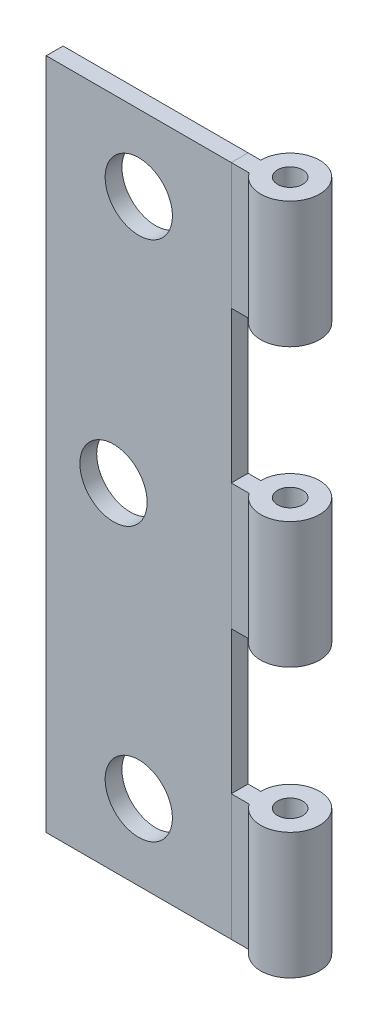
ISO-10303-21;
HEADER;
FILE_DESCRIPTION(('STEP AP214'),'2;1');
FILE_NAME('part.step','',(''),(''),'','','');
FILE_SCHEMA(('AUTOMOTIVE_DESIGN { 1 0 10303 214 1 1 1 1 }'));
ENDSEC;
DATA;
#1=APPLICATION_CONTEXT('core data for automotive mechanical design processes');
#2=APPLICATION_PROTOCOL_DEFINITION('international standard','automotive_design',2000,#1);
#3=PRODUCT_CONTEXT('',#1,'mechanical');
#4=PRODUCT('Part','Part','',(#3));
#5=PRODUCT_RELATED_PRODUCT_CATEGORY('part','',(#4));
#6=PRODUCT_DEFINITION_FORMATION('','',#4);
#7=PRODUCT_DEFINITION_CONTEXT('part definition',#1,'design');
#8=PRODUCT_DEFINITION('design','',#6,#7);
#9=PRODUCT_DEFINITION_SHAPE('','',#8);
#10=(LENGTH_UNIT() NAMED_UNIT(*) SI_UNIT(.MILLI.,.METRE.));
#11=(NAMED_UNIT(*) PLANE_ANGLE_UNIT() SI_UNIT($,.RADIAN.));
#12=(NAMED_UNIT(*) SI_UNIT($,.STERADIAN.) SOLID_ANGLE_UNIT());
#13=UNCERTAINTY_MEASURE_WITH_UNIT(LENGTH_MEASURE(1.E-05),#10,'distance_accuracy_value','');
#14=(GEOMETRIC_REPRESENTATION_CONTEXT(3) GLOBAL_UNCERTAINTY_ASSIGNED_CONTEXT((#13)) GLOBAL_UNIT_ASSIGNED_CONTEXT((#10,
#11,#12)) REPRESENTATION_CONTEXT('',''));
#15=CARTESIAN_POINT('',(0.,0.,0.));
#16=DIRECTION('',(0.,0.,1.));
#17=DIRECTION('',(1.,0.,0.));
#18=AXIS2_PLACEMENT_3D('',#15,#16,#17);
#19=CARTESIAN_POINT('',(12.7,-39.6077241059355,-1.5875));
#20=DIRECTION('',(0.,1.,0.));
#21=DIRECTION('',(0.,0.,1.));
#22=AXIS2_PLACEMENT_3D('',#19,#20,#21);
#23=CYLINDRICAL_SURFACE('',#22,1.190625);
#24=CARTESIAN_POINT('',(12.7,5.55624999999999,-1.5875));
#25=DIRECTION('',(0.,-1.,0.));
#26=DIRECTION('',(0.,0.,-1.));
#27=AXIS2_PLACEMENT_3D('',#24,#25,#26);
#28=CIRCLE('',#27,1.190625);
#29=CARTESIAN_POINT('',(12.7,5.55624999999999,-2.778125));
#30=VERTEX_POINT('',#29);
#31=EDGE_CURVE('E138',#30,#30,#28,.F.);
#32=ORIENTED_EDGE('',*,*,#31,.T.);
#33=EDGE_LOOP('',(#32));
#34=FACE_BOUND('',#33,.T.);
#35=CARTESIAN_POINT('',(12.7,-6.35,-1.5875));
#36=DIRECTION('',(0.,-1.,0.));
#37=DIRECTION('',(0.,0.,-1.));
#38=AXIS2_PLACEMENT_3D('',#35,#36,#37);
#39=CIRCLE('',#38,1.190625);
#40=CARTESIAN_POINT('',(12.7,-6.35,-2.778125));
#41=VERTEX_POINT('',#40);
#42=EDGE_CURVE('E13',#41,#41,#39,.F.);
#43=ORIENTED_EDGE('',*,*,#42,.F.);
#44=EDGE_LOOP('',(#43));
#45=FACE_BOUND('',#44,.T.);
#46=ADVANCED_FACE('F67',(#34,#45),#23,.F.);
#47=CARTESIAN_POINT('',(8.73125000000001,-39.6077241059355,0.));
#48=DIRECTION('',(0.,0.,1.));
#49=DIRECTION('',(1.,0.,0.));
#50=AXIS2_PLACEMENT_3D('',#47,#48,#49);
#51=PLANE('',#50);
#52=DIRECTION('',(0.,1.,0.));
#53=VECTOR('',#52,1.);
#54=CARTESIAN_POINT('',(8.73125000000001,-39.6077241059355,0.));
#55=LINE('',#54,#53);
#56=CARTESIAN_POINT('',(8.73125000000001,-6.35,0.));
#57=VERTEX_POINT('',#56);
#58=CARTESIAN_POINT('',(8.73125000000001,5.55625,0.));
#59=VERTEX_POINT('',#58);
#60=EDGE_CURVE('E129',#57,#59,#55,.T.);
#61=ORIENTED_EDGE('',*,*,#60,.F.);
#62=DIRECTION('',(1.,0.,0.));
#63=VECTOR('',#62,1.);
#64=CARTESIAN_POINT('',(8.73125000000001,-6.35,0.));
#65=LINE('',#64,#63);
#66=CARTESIAN_POINT('',(10.4201266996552,-6.35,0.));
#67=VERTEX_POINT('',#66);
#68=EDGE_CURVE('E84',#57,#67,#65,.T.);
#69=ORIENTED_EDGE('',*,*,#68,.T.);
#70=DIRECTION('',(0.,1.,0.));
#71=VECTOR('',#70,1.);
#72=CARTESIAN_POINT('',(10.4201266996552,-39.6077241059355,0.));
#73=LINE('',#72,#71);
#74=CARTESIAN_POINT('',(10.4201266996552,5.55624999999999,0.));
#75=VERTEX_POINT('',#74);
#76=EDGE_CURVE('E71',#67,#75,#73,.T.);
#77=ORIENTED_EDGE('',*,*,#76,.T.);
#78=DIRECTION('',(1.,0.,0.));
#79=VECTOR('',#78,1.);
#80=CARTESIAN_POINT('',(8.73125000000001,5.55624999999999,0.));
#81=LINE('',#80,#79);
#82=EDGE_CURVE('E135',#59,#75,#81,.T.);
#83=ORIENTED_EDGE('',*,*,#82,.F.);
#84=EDGE_LOOP('',(#61,#69,#77,#83));
#85=FACE_BOUND('',#84,.T.);
#86=ADVANCED_FACE('F69',(#85),#51,.T.);
#87=CARTESIAN_POINT('',(8.73125000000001,-39.6077241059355,-1.5875));
#88=DIRECTION('',(0.,0.,1.));
#89=DIRECTION('',(1.,0.,0.));
#90=AXIS2_PLACEMENT_3D('',#87,#88,#89);
#91=PLANE('',#90);
#92=DIRECTION('',(1.,0.,0.));
#93=VECTOR('',#92,1.);
#94=CARTESIAN_POINT('',(8.73125000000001,-6.35,-1.5875));
#95=LINE('',#94,#93);
#96=CARTESIAN_POINT('',(8.73125000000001,-6.35,-1.5875));
#97=VERTEX_POINT('',#96);
#98=CARTESIAN_POINT('',(9.92187500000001,-6.35,-1.5875));
#99=VERTEX_POINT('',#98);
#100=EDGE_CURVE('E76',#97,#99,#95,.T.);
#101=ORIENTED_EDGE('',*,*,#100,.F.);
#102=DIRECTION('',(0.,1.,0.));
#103=VECTOR('',#102,1.);
#104=CARTESIAN_POINT('',(8.73125000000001,-39.6077241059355,-1.5875));
#105=LINE('',#104,#103);
#106=CARTESIAN_POINT('',(8.73125000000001,5.55624999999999,-1.5875));
#107=VERTEX_POINT('',#106);
#108=EDGE_CURVE('E115',#97,#107,#105,.T.);
#109=ORIENTED_EDGE('',*,*,#108,.T.);
#110=DIRECTION('',(1.,0.,0.));
#111=VECTOR('',#110,1.);
#112=CARTESIAN_POINT('',(8.73125000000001,5.55624999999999,-1.5875));
#113=LINE('',#112,#111);
#114=CARTESIAN_POINT('',(9.92187500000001,5.55624999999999,-1.5875));
#115=VERTEX_POINT('',#114);
#116=EDGE_CURVE('E118',#107,#115,#113,.T.);
#117=ORIENTED_EDGE('',*,*,#116,.T.);
#118=DIRECTION('',(0.,1.,0.));
#119=VECTOR('',#118,1.);
#120=CARTESIAN_POINT('',(9.92187500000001,-39.6077241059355,-1.5875));
#121=LINE('',#120,#119);
#122=EDGE_CURVE('E103',#99,#115,#121,.T.);
#123=ORIENTED_EDGE('',*,*,#122,.F.);
#124=EDGE_LOOP('',(#101,#109,#117,#123));
#125=FACE_BOUND('',#124,.T.);
#126=ADVANCED_FACE('F117',(#125),#91,.F.);
#127=CARTESIAN_POINT('',(8.73125000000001,-39.6077241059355,-1.5875));
#128=DIRECTION('',(-1.,0.,0.));
#129=DIRECTION('',(0.,0.,1.));
#130=AXIS2_PLACEMENT_3D('',#127,#128,#129);
#131=PLANE('',#130);
#132=ORIENTED_EDGE('',*,*,#108,.F.);
#133=DIRECTION('',(0.,0.,-1.));
#134=VECTOR('',#133,1.);
#135=CARTESIAN_POINT('',(8.73125000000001,-6.35,1.190625));
#136=LINE('',#135,#134);
#137=EDGE_CURVE('E95',#57,#97,#136,.T.);
#138=ORIENTED_EDGE('',*,*,#137,.F.);
#139=ORIENTED_EDGE('',*,*,#60,.T.);
#140=DIRECTION('',(0.,0.,1.));
#141=VECTOR('',#140,1.);
#142=CARTESIAN_POINT('',(8.73125000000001,5.55624999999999,-1.5875));
#143=LINE('',#142,#141);
#144=EDGE_CURVE('E126',#107,#59,#143,.T.);
#145=ORIENTED_EDGE('',*,*,#144,.F.);
#146=EDGE_LOOP('',(#132,#138,#139,#145));
#147=FACE_BOUND('',#146,.T.);
#148=ADVANCED_FACE('F131',(#147),#131,.T.);
#149=CARTESIAN_POINT('',(12.7,-39.6077241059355,-1.5875));
#150=DIRECTION('',(0.,1.,0.));
#151=DIRECTION('',(0.,0.,1.));
#152=AXIS2_PLACEMENT_3D('',#149,#150,#151);
#153=CYLINDRICAL_SURFACE('',#152,2.778125);
#154=CARTESIAN_POINT('',(12.7,-6.35,-1.5875));
#155=DIRECTION('',(0.,-1.,0.));
#156=DIRECTION('',(0.,0.,-1.));
#157=AXIS2_PLACEMENT_3D('',#154,#155,#156);
#158=CIRCLE('',#157,2.778125);
#159=EDGE_CURVE('E90',#67,#99,#158,.F.);
#160=ORIENTED_EDGE('',*,*,#159,.T.);
#161=ORIENTED_EDGE('',*,*,#122,.T.);
#162=CARTESIAN_POINT('',(12.7,5.55624999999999,-1.5875));
#163=DIRECTION('',(0.,-1.,0.));
#164=DIRECTION('',(0.,0.,-1.));
#165=AXIS2_PLACEMENT_3D('',#162,#163,#164);
#166=CIRCLE('',#165,2.778125);
#167=EDGE_CURVE('E128',#75,#115,#166,.F.);
#168=ORIENTED_EDGE('',*,*,#167,.F.);
#169=ORIENTED_EDGE('',*,*,#76,.F.);
#170=EDGE_LOOP('',(#160,#161,#168,#169));
#171=FACE_BOUND('',#170,.T.);
#172=ADVANCED_FACE('F147',(#171),#153,.T.);
#173=CARTESIAN_POINT('',(0.,5.55625,1.190625));
#174=DIRECTION('',(0.,-1.,0.));
#175=DIRECTION('',(0.,0.,-1.));
#176=AXIS2_PLACEMENT_3D('',#173,#174,#175);
#177=PLANE('',#176);
#178=ORIENTED_EDGE('',*,*,#82,.T.);
#179=ORIENTED_EDGE('',*,*,#167,.T.);
#180=ORIENTED_EDGE('',*,*,#116,.F.);
#181=ORIENTED_EDGE('',*,*,#144,.T.);
#182=EDGE_LOOP('',(#178,#179,#180,#181));
#183=FACE_BOUND('',#182,.T.);
#184=ORIENTED_EDGE('',*,*,#31,.F.);
#185=EDGE_LOOP('',(#184));
#186=FACE_BOUND('',#185,.T.);
#187=ADVANCED_FACE('F124',(#183,#186),#177,.F.);
#188=CARTESIAN_POINT('',(0.,-6.35,1.190625));
#189=DIRECTION('',(0.,-1.,0.));
#190=DIRECTION('',(0.,0.,-1.));
#191=AXIS2_PLACEMENT_3D('',#188,#189,#190);
#192=PLANE('',#191);
#193=ORIENTED_EDGE('',*,*,#137,.T.);
#194=ORIENTED_EDGE('',*,*,#100,.T.);
#195=ORIENTED_EDGE('',*,*,#159,.F.);
#196=ORIENTED_EDGE('',*,*,#68,.F.);
#197=EDGE_LOOP('',(#193,#194,#195,#196));
#198=FACE_BOUND('',#197,.T.);
#199=ORIENTED_EDGE('',*,*,#42,.T.);
#200=EDGE_LOOP('',(#199));
#201=FACE_BOUND('',#200,.T.);
#202=ADVANCED_FACE('F161',(#198,#201),#192,.T.);
#203=CLOSED_SHELL('',(#46,#86,#126,#148,#172,#187,#202));
#204=MANIFOLD_SOLID_BREP('B2',#203);
#205=CARTESIAN_POINT('',(12.7,-39.6077241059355,-1.5875));
#206=DIRECTION('',(0.,1.,0.));
#207=DIRECTION('',(0.,0.,1.));
#208=AXIS2_PLACEMENT_3D('',#205,#206,#207);
#209=CYLINDRICAL_SURFACE('',#208,1.190625);
#210=CARTESIAN_POINT('',(12.7,-31.75,-1.5875));
#211=DIRECTION('',(0.,-1.,0.));
#212=DIRECTION('',(0.,0.,-1.));
#213=AXIS2_PLACEMENT_3D('',#210,#211,#212);
#214=CIRCLE('',#213,1.190625);
#215=CARTESIAN_POINT('',(12.7,-31.75,-2.778125));
#216=VERTEX_POINT('',#215);
#217=EDGE_CURVE('E231',#216,#216,#214,.F.);
#218=ORIENTED_EDGE('',*,*,#217,.F.);
#219=EDGE_LOOP('',(#218));
#220=FACE_BOUND('',#219,.T.);
#221=CARTESIAN_POINT('',(12.7,-19.84375,-1.5875));
#222=DIRECTION('',(0.,1.,0.));
#223=DIRECTION('',(0.,0.,1.));
#224=AXIS2_PLACEMENT_3D('',#221,#222,#223);
#225=CIRCLE('',#224,1.190625);
#226=CARTESIAN_POINT('',(12.7,-19.84375,-0.396875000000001));
#227=VERTEX_POINT('',#226);
#228=EDGE_CURVE('E282',#227,#227,#225,.F.);
#229=ORIENTED_EDGE('',*,*,#228,.F.);
#230=EDGE_LOOP('',(#229));
#231=FACE_BOUND('',#230,.T.);
#232=ADVANCED_FACE('F222',(#220,#231),#209,.F.);
#233=CARTESIAN_POINT('',(-8.73124999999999,-31.75,-1.5875));
#234=DIRECTION('',(0.,-1.,0.));
#235=DIRECTION('',(0.,0.,-1.));
#236=AXIS2_PLACEMENT_3D('',#233,#234,#235);
#237=PLANE('',#236);
#238=CARTESIAN_POINT('',(12.7,-31.75,-1.5875));
#239=DIRECTION('',(0.,-1.,0.));
#240=DIRECTION('',(0.,0.,-1.));
#241=AXIS2_PLACEMENT_3D('',#238,#239,#240);
#242=CIRCLE('',#241,2.778125);
#243=CARTESIAN_POINT('',(10.4201266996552,-31.75,0.));
#244=VERTEX_POINT('',#243);
#245=CARTESIAN_POINT('',(9.92187500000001,-31.75,-1.5875));
#246=VERTEX_POINT('',#245);
#247=EDGE_CURVE('E285',#244,#246,#242,.F.);
#248=ORIENTED_EDGE('',*,*,#247,.F.);
#249=DIRECTION('',(1.,0.,0.));
#250=VECTOR('',#249,1.);
#251=CARTESIAN_POINT('',(8.73125000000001,-31.75,0.));
#252=LINE('',#251,#250);
#253=CARTESIAN_POINT('',(8.73125000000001,-31.75,0.));
#254=VERTEX_POINT('',#253);
#255=EDGE_CURVE('E293',#254,#244,#252,.T.);
#256=ORIENTED_EDGE('',*,*,#255,.F.);
#257=DIRECTION('',(0.,0.,1.));
#258=VECTOR('',#257,1.);
#259=CARTESIAN_POINT('',(8.73125000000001,-31.75,-1.5875));
#260=LINE('',#259,#258);
#261=CARTESIAN_POINT('',(8.73125000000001,-31.75,-1.5875));
#262=VERTEX_POINT('',#261);
#263=EDGE_CURVE('E239',#262,#254,#260,.T.);
#264=ORIENTED_EDGE('',*,*,#263,.F.);
#265=DIRECTION('',(1.,0.,0.));
#266=VECTOR('',#265,1.);
#267=CARTESIAN_POINT('',(8.73125000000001,-31.75,-1.5875));
#268=LINE('',#267,#266);
#269=EDGE_CURVE('E301',#262,#246,#268,.T.);
#270=ORIENTED_EDGE('',*,*,#269,.T.);
#271=EDGE_LOOP('',(#248,#256,#264,#270));
#272=FACE_BOUND('',#271,.T.);
#273=ORIENTED_EDGE('',*,*,#217,.T.);
#274=EDGE_LOOP('',(#273));
#275=FACE_BOUND('',#274,.T.);
#276=ADVANCED_FACE('F303',(#272,#275),#237,.T.);
#277=CARTESIAN_POINT('',(8.73125000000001,-39.6077241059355,-1.5875));
#278=DIRECTION('',(-1.,0.,0.));
#279=DIRECTION('',(0.,0.,1.));
#280=AXIS2_PLACEMENT_3D('',#277,#278,#279);
#281=PLANE('',#280);
#282=DIRECTION('',(0.,1.,0.));
#283=VECTOR('',#282,1.);
#284=CARTESIAN_POINT('',(8.73125000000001,-39.6077241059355,0.));
#285=LINE('',#284,#283);
#286=CARTESIAN_POINT('',(8.73125000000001,-19.84375,0.));
#287=VERTEX_POINT('',#286);
#288=EDGE_CURVE('E280',#254,#287,#285,.T.);
#289=ORIENTED_EDGE('',*,*,#288,.T.);
#290=DIRECTION('',(0.,0.,-1.));
#291=VECTOR('',#290,1.);
#292=CARTESIAN_POINT('',(8.73125000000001,-19.84375,1.190625));
#293=LINE('',#292,#291);
#294=CARTESIAN_POINT('',(8.73125000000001,-19.84375,-1.5875));
#295=VERTEX_POINT('',#294);
#296=EDGE_CURVE('E265',#287,#295,#293,.T.);
#297=ORIENTED_EDGE('',*,*,#296,.T.);
#298=DIRECTION('',(0.,1.,0.));
#299=VECTOR('',#298,1.);
#300=CARTESIAN_POINT('',(8.73125000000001,-39.6077241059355,-1.5875));
#301=LINE('',#300,#299);
#302=EDGE_CURVE('E289',#262,#295,#301,.T.);
#303=ORIENTED_EDGE('',*,*,#302,.F.);
#304=ORIENTED_EDGE('',*,*,#263,.T.);
#305=EDGE_LOOP('',(#289,#297,#303,#304));
#306=FACE_BOUND('',#305,.T.);
#307=ADVANCED_FACE('F284',(#306),#281,.T.);
#308=CARTESIAN_POINT('',(12.7,-39.6077241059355,-1.5875));
#309=DIRECTION('',(0.,1.,0.));
#310=DIRECTION('',(0.,0.,1.));
#311=AXIS2_PLACEMENT_3D('',#308,#309,#310);
#312=CYLINDRICAL_SURFACE('',#311,2.778125);
#313=CARTESIAN_POINT('',(12.7,-19.84375,-1.5875));
#314=DIRECTION('',(0.,1.,0.));
#315=DIRECTION('',(0.,0.,1.));
#316=AXIS2_PLACEMENT_3D('',#313,#314,#315);
#317=CIRCLE('',#316,2.778125);
#318=CARTESIAN_POINT('',(9.92187500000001,-19.84375,-1.5875));
#319=VERTEX_POINT('',#318);
#320=CARTESIAN_POINT('',(10.4201266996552,-19.84375,0.));
#321=VERTEX_POINT('',#320);
#322=EDGE_CURVE('E65',#319,#321,#317,.F.);
#323=ORIENTED_EDGE('',*,*,#322,.T.);
#324=DIRECTION('',(0.,1.,0.));
#325=VECTOR('',#324,1.);
#326=CARTESIAN_POINT('',(10.4201266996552,-39.6077241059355,0.));
#327=LINE('',#326,#325);
#328=EDGE_CURVE('E281',#244,#321,#327,.T.);
#329=ORIENTED_EDGE('',*,*,#328,.F.);
#330=ORIENTED_EDGE('',*,*,#247,.T.);
#331=DIRECTION('',(0.,1.,0.));
#332=VECTOR('',#331,1.);
#333=CARTESIAN_POINT('',(9.92187500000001,-39.6077241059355,-1.5875));
#334=LINE('',#333,#332);
#335=EDGE_CURVE('E250',#246,#319,#334,.T.);
#336=ORIENTED_EDGE('',*,*,#335,.T.);
#337=EDGE_LOOP('',(#323,#329,#330,#336));
#338=FACE_BOUND('',#337,.T.);
#339=ADVANCED_FACE('F224',(#338),#312,.T.);
#340=CARTESIAN_POINT('',(8.73125000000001,-39.6077241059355,-1.5875));
#341=DIRECTION('',(0.,0.,1.));
#342=DIRECTION('',(1.,0.,0.));
#343=AXIS2_PLACEMENT_3D('',#340,#341,#342);
#344=PLANE('',#343);
#345=DIRECTION('',(-1.,0.,0.));
#346=VECTOR('',#345,1.);
#347=CARTESIAN_POINT('',(8.73125000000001,-19.84375,-1.5875));
#348=LINE('',#347,#346);
#349=EDGE_CURVE('E271',#319,#295,#348,.T.);
#350=ORIENTED_EDGE('',*,*,#349,.F.);
#351=ORIENTED_EDGE('',*,*,#335,.F.);
#352=ORIENTED_EDGE('',*,*,#269,.F.);
#353=ORIENTED_EDGE('',*,*,#302,.T.);
#354=EDGE_LOOP('',(#350,#351,#352,#353));
#355=FACE_BOUND('',#354,.T.);
#356=ADVANCED_FACE('F306',(#355),#344,.F.);
#357=CARTESIAN_POINT('',(8.73125000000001,-39.6077241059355,0.));
#358=DIRECTION('',(0.,0.,1.));
#359=DIRECTION('',(1.,0.,0.));
#360=AXIS2_PLACEMENT_3D('',#357,#358,#359);
#361=PLANE('',#360);
#362=ORIENTED_EDGE('',*,*,#328,.T.);
#363=DIRECTION('',(-1.,0.,0.));
#364=VECTOR('',#363,1.);
#365=CARTESIAN_POINT('',(8.73125000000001,-19.84375,0.));
#366=LINE('',#365,#364);
#367=EDGE_CURVE('E269',#321,#287,#366,.T.);
#368=ORIENTED_EDGE('',*,*,#367,.T.);
#369=ORIENTED_EDGE('',*,*,#288,.F.);
#370=ORIENTED_EDGE('',*,*,#255,.T.);
#371=EDGE_LOOP('',(#362,#368,#369,#370));
#372=FACE_BOUND('',#371,.T.);
#373=ADVANCED_FACE('F278',(#372),#361,.T.);
#374=CARTESIAN_POINT('',(0.,-19.84375,1.190625));
#375=DIRECTION('',(0.,1.,0.));
#376=DIRECTION('',(0.,0.,1.));
#377=AXIS2_PLACEMENT_3D('',#374,#375,#376);
#378=PLANE('',#377);
#379=ORIENTED_EDGE('',*,*,#367,.F.);
#380=ORIENTED_EDGE('',*,*,#322,.F.);
#381=ORIENTED_EDGE('',*,*,#349,.T.);
#382=ORIENTED_EDGE('',*,*,#296,.F.);
#383=EDGE_LOOP('',(#379,#380,#381,#382));
#384=FACE_BOUND('',#383,.T.);
#385=ORIENTED_EDGE('',*,*,#228,.T.);
#386=EDGE_LOOP('',(#385));
#387=FACE_BOUND('',#386,.T.);
#388=ADVANCED_FACE('F267',(#384,#387),#378,.T.);
#389=CLOSED_SHELL('',(#232,#276,#307,#339,#356,#373,#388));
#390=MANIFOLD_SOLID_BREP('B7',#389);
#391=CARTESIAN_POINT('',(12.7,-39.6077241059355,-1.5875));
#392=DIRECTION('',(0.,1.,0.));
#393=DIRECTION('',(0.,0.,1.));
#394=AXIS2_PLACEMENT_3D('',#391,#392,#393);
#395=CYLINDRICAL_SURFACE('',#394,1.190625);
#396=CARTESIAN_POINT('',(12.7,19.84375,-1.5875));
#397=DIRECTION('',(0.,1.,0.));
#398=DIRECTION('',(-1.,0.,0.));
#399=AXIS2_PLACEMENT_3D('',#396,#397,#398);
#400=CIRCLE('',#399,1.190625);
#401=CARTESIAN_POINT('',(11.509375,19.84375,-1.5875));
#402=VERTEX_POINT('',#401);
#403=EDGE_CURVE('E435',#402,#402,#400,.F.);
#404=ORIENTED_EDGE('',*,*,#403,.T.);
#405=EDGE_LOOP('',(#404));
#406=FACE_BOUND('',#405,.T.);
#407=CARTESIAN_POINT('',(12.7,31.75,-1.5875));
#408=DIRECTION('',(0.,1.,0.));
#409=DIRECTION('',(0.,0.,1.));
#410=AXIS2_PLACEMENT_3D('',#407,#408,#409);
#411=CIRCLE('',#410,1.190625);
#412=CARTESIAN_POINT('',(12.7,31.75,-0.396875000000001));
#413=VERTEX_POINT('',#412);
#414=EDGE_CURVE('E422',#413,#413,#411,.T.);
#415=ORIENTED_EDGE('',*,*,#414,.T.);
#416=EDGE_LOOP('',(#415));
#417=FACE_BOUND('',#416,.T.);
#418=ADVANCED_FACE('F379',(#406,#417),#395,.F.);
#419=CARTESIAN_POINT('',(0.,31.75,0.));
#420=DIRECTION('',(0.,1.,0.));
#421=DIRECTION('',(0.,0.,1.));
#422=AXIS2_PLACEMENT_3D('',#419,#420,#421);
#423=PLANE('',#422);
#424=DIRECTION('',(1.,0.,0.));
#425=VECTOR('',#424,1.);
#426=CARTESIAN_POINT('',(8.73125000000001,31.75,0.));
#427=LINE('',#426,#425);
#428=CARTESIAN_POINT('',(8.73125000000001,31.75,0.));
#429=VERTEX_POINT('',#428);
#430=CARTESIAN_POINT('',(10.4201266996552,31.75,0.));
#431=VERTEX_POINT('',#430);
#432=EDGE_CURVE('E425',#429,#431,#427,.T.);
#433=ORIENTED_EDGE('',*,*,#432,.T.);
#434=CARTESIAN_POINT('',(12.7,31.75,-1.5875));
#435=DIRECTION('',(0.,1.,0.));
#436=DIRECTION('',(0.,0.,1.));
#437=AXIS2_PLACEMENT_3D('',#434,#435,#436);
#438=CIRCLE('',#437,2.778125);
#439=CARTESIAN_POINT('',(9.92187500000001,31.75,-1.5875));
#440=VERTEX_POINT('',#439);
#441=EDGE_CURVE('E445',#431,#440,#438,.T.);
#442=ORIENTED_EDGE('',*,*,#441,.T.);
#443=DIRECTION('',(1.,0.,0.));
#444=VECTOR('',#443,1.);
#445=CARTESIAN_POINT('',(8.73125000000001,31.75,-1.5875));
#446=LINE('',#445,#444);
#447=CARTESIAN_POINT('',(8.73125000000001,31.75,-1.5875));
#448=VERTEX_POINT('',#447);
#449=EDGE_CURVE('E423',#448,#440,#446,.T.);
#450=ORIENTED_EDGE('',*,*,#449,.F.);
#451=DIRECTION('',(0.,0.,1.));
#452=VECTOR('',#451,1.);
#453=CARTESIAN_POINT('',(8.73125000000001,31.75,-1.5875));
#454=LINE('',#453,#452);
#455=EDGE_CURVE('E420',#448,#429,#454,.T.);
#456=ORIENTED_EDGE('',*,*,#455,.T.);
#457=EDGE_LOOP('',(#433,#442,#450,#456));
#458=FACE_BOUND('',#457,.T.);
#459=ORIENTED_EDGE('',*,*,#414,.F.);
#460=EDGE_LOOP('',(#459));
#461=FACE_BOUND('',#460,.T.);
#462=ADVANCED_FACE('F433',(#458,#461),#423,.T.);
#463=CARTESIAN_POINT('',(8.73125000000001,-39.6077241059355,-1.5875));
#464=DIRECTION('',(-1.,0.,0.));
#465=DIRECTION('',(0.,0.,1.));
#466=AXIS2_PLACEMENT_3D('',#463,#464,#465);
#467=PLANE('',#466);
#468=DIRECTION('',(0.,0.,-1.));
#469=VECTOR('',#468,1.);
#470=CARTESIAN_POINT('',(8.73125000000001,19.84375,-1.5875));
#471=LINE('',#470,#469);
#472=CARTESIAN_POINT('',(8.73125000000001,19.84375,0.));
#473=VERTEX_POINT('',#472);
#474=CARTESIAN_POINT('',(8.73125000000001,19.84375,-1.5875));
#475=VERTEX_POINT('',#474);
#476=EDGE_CURVE('E220',#473,#475,#471,.T.);
#477=ORIENTED_EDGE('',*,*,#476,.F.);
#478=DIRECTION('',(0.,1.,0.));
#479=VECTOR('',#478,1.);
#480=CARTESIAN_POINT('',(8.73125000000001,-39.6077241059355,0.));
#481=LINE('',#480,#479);
#482=EDGE_CURVE('E415',#473,#429,#481,.T.);
#483=ORIENTED_EDGE('',*,*,#482,.T.);
#484=ORIENTED_EDGE('',*,*,#455,.F.);
#485=DIRECTION('',(0.,1.,0.));
#486=VECTOR('',#485,1.);
#487=CARTESIAN_POINT('',(8.73125000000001,-39.6077241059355,-1.5875));
#488=LINE('',#487,#486);
#489=EDGE_CURVE('E430',#475,#448,#488,.T.);
#490=ORIENTED_EDGE('',*,*,#489,.F.);
#491=EDGE_LOOP('',(#477,#483,#484,#490));
#492=FACE_BOUND('',#491,.T.);
#493=ADVANCED_FACE('F417',(#492),#467,.T.);
#494=CARTESIAN_POINT('',(8.73125000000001,-39.6077241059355,-1.5875));
#495=DIRECTION('',(0.,0.,1.));
#496=DIRECTION('',(1.,0.,0.));
#497=AXIS2_PLACEMENT_3D('',#494,#495,#496);
#498=PLANE('',#497);
#499=DIRECTION('',(0.,1.,0.));
#500=VECTOR('',#499,1.);
#501=CARTESIAN_POINT('',(9.92187500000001,-39.6077241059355,-1.5875));
#502=LINE('',#501,#500);
#503=CARTESIAN_POINT('',(9.92187500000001,19.84375,-1.5875));
#504=VERTEX_POINT('',#503);
#505=EDGE_CURVE('E387',#504,#440,#502,.T.);
#506=ORIENTED_EDGE('',*,*,#505,.F.);
#507=DIRECTION('',(-1.,0.,0.));
#508=VECTOR('',#507,1.);
#509=CARTESIAN_POINT('',(8.73125000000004,19.84375,-1.5875));
#510=LINE('',#509,#508);
#511=EDGE_CURVE('E453',#504,#475,#510,.T.);
#512=ORIENTED_EDGE('',*,*,#511,.T.);
#513=ORIENTED_EDGE('',*,*,#489,.T.);
#514=ORIENTED_EDGE('',*,*,#449,.T.);
#515=EDGE_LOOP('',(#506,#512,#513,#514));
#516=FACE_BOUND('',#515,.T.);
#517=ADVANCED_FACE('F456',(#516),#498,.F.);
#518=CARTESIAN_POINT('',(8.73125000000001,-39.6077241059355,0.));
#519=DIRECTION('',(0.,0.,1.));
#520=DIRECTION('',(1.,0.,0.));
#521=AXIS2_PLACEMENT_3D('',#518,#519,#520);
#522=PLANE('',#521);
#523=DIRECTION('',(-1.,0.,0.));
#524=VECTOR('',#523,1.);
#525=CARTESIAN_POINT('',(8.73125000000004,19.84375,0.));
#526=LINE('',#525,#524);
#527=CARTESIAN_POINT('',(10.4201266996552,19.84375,0.));
#528=VERTEX_POINT('',#527);
#529=EDGE_CURVE('E393',#528,#473,#526,.T.);
#530=ORIENTED_EDGE('',*,*,#529,.F.);
#531=DIRECTION('',(0.,1.,0.));
#532=VECTOR('',#531,1.);
#533=CARTESIAN_POINT('',(10.4201266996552,-39.6077241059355,0.));
#534=LINE('',#533,#532);
#535=EDGE_CURVE('E427',#528,#431,#534,.T.);
#536=ORIENTED_EDGE('',*,*,#535,.T.);
#537=ORIENTED_EDGE('',*,*,#432,.F.);
#538=ORIENTED_EDGE('',*,*,#482,.F.);
#539=EDGE_LOOP('',(#530,#536,#537,#538));
#540=FACE_BOUND('',#539,.T.);
#541=ADVANCED_FACE('F381',(#540),#522,.T.);
#542=CARTESIAN_POINT('',(12.7,-39.6077241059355,-1.5875));
#543=DIRECTION('',(0.,1.,0.));
#544=DIRECTION('',(0.,0.,1.));
#545=AXIS2_PLACEMENT_3D('',#542,#543,#544);
#546=CYLINDRICAL_SURFACE('',#545,2.778125);
#547=CARTESIAN_POINT('',(12.7,19.84375,-1.5875));
#548=DIRECTION('',(0.,1.,0.));
#549=DIRECTION('',(-1.,0.,0.));
#550=AXIS2_PLACEMENT_3D('',#547,#548,#549);
#551=CIRCLE('',#550,2.778125);
#552=EDGE_CURVE('E451',#504,#528,#551,.F.);
#553=ORIENTED_EDGE('',*,*,#552,.F.);
#554=ORIENTED_EDGE('',*,*,#505,.T.);
#555=ORIENTED_EDGE('',*,*,#441,.F.);
#556=ORIENTED_EDGE('',*,*,#535,.F.);
#557=EDGE_LOOP('',(#553,#554,#555,#556));
#558=FACE_BOUND('',#557,.T.);
#559=ADVANCED_FACE('F462',(#558),#546,.T.);
#560=CARTESIAN_POINT('',(0.,19.84375,1.190625));
#561=DIRECTION('',(0.,1.,0.));
#562=DIRECTION('',(-1.,0.,0.));
#563=AXIS2_PLACEMENT_3D('',#560,#561,#562);
#564=PLANE('',#563);
#565=ORIENTED_EDGE('',*,*,#529,.T.);
#566=ORIENTED_EDGE('',*,*,#476,.T.);
#567=ORIENTED_EDGE('',*,*,#511,.F.);
#568=ORIENTED_EDGE('',*,*,#552,.T.);
#569=EDGE_LOOP('',(#565,#566,#567,#568));
#570=FACE_BOUND('',#569,.T.);
#571=ORIENTED_EDGE('',*,*,#403,.F.);
#572=EDGE_LOOP('',(#571));
#573=FACE_BOUND('',#572,.T.);
#574=ADVANCED_FACE('F459',(#570,#573),#564,.F.);
#575=CLOSED_SHELL('',(#418,#462,#493,#517,#541,#559,#574));
#576=MANIFOLD_SOLID_BREP('B59',#575);
#577=CARTESIAN_POINT('',(8.73125000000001,-31.75,-1.5875));
#578=DIRECTION('',(1.,0.,0.));
#579=DIRECTION('',(0.,0.,-1.));
#580=AXIS2_PLACEMENT_3D('',#577,#578,#579);
#581=PLANE('',#580);
#582=DIRECTION('',(0.,1.,0.));
#583=VECTOR('',#582,1.);
#584=CARTESIAN_POINT('',(8.73125000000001,-31.75,0.));
#585=LINE('',#584,#583);
#586=CARTESIAN_POINT('',(8.73125000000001,-31.75,0.));
#587=VERTEX_POINT('',#586);
#588=CARTESIAN_POINT('',(8.73125000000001,31.75,0.));
#589=VERTEX_POINT('',#588);
#590=EDGE_CURVE('E600',#587,#589,#585,.T.);
#591=ORIENTED_EDGE('',*,*,#590,.F.);
#592=DIRECTION('',(0.,0.,1.));
#593=VECTOR('',#592,1.);
#594=CARTESIAN_POINT('',(8.73125000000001,-31.75,-1.5875));
#595=LINE('',#594,#593);
#596=CARTESIAN_POINT('',(8.73125000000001,-31.75,-1.5875));
#597=VERTEX_POINT('',#596);
#598=EDGE_CURVE('E377',#597,#587,#595,.T.);
#599=ORIENTED_EDGE('',*,*,#598,.F.);
#600=DIRECTION('',(0.,1.,0.));
#601=VECTOR('',#600,1.);
#602=CARTESIAN_POINT('',(8.73125000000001,-31.75,-1.5875));
#603=LINE('',#602,#601);
#604=CARTESIAN_POINT('',(8.73125000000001,31.75,-1.5875));
#605=VERTEX_POINT('',#604);
#606=EDGE_CURVE('E593',#597,#605,#603,.T.);
#607=ORIENTED_EDGE('',*,*,#606,.T.);
#608=DIRECTION('',(0.,0.,1.));
#609=VECTOR('',#608,1.);
#610=CARTESIAN_POINT('',(8.73125000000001,31.75,-1.5875));
#611=LINE('',#610,#609);
#612=EDGE_CURVE('E576',#605,#589,#611,.T.);
#613=ORIENTED_EDGE('',*,*,#612,.T.);
#614=EDGE_LOOP('',(#591,#599,#607,#613));
#615=FACE_BOUND('',#614,.T.);
#616=ADVANCED_FACE('F533',(#615),#581,.T.);
#617=CARTESIAN_POINT('',(-8.73124999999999,-31.75,-1.5875));
#618=DIRECTION('',(0.,-1.,0.));
#619=DIRECTION('',(0.,0.,-1.));
#620=AXIS2_PLACEMENT_3D('',#617,#618,#619);
#621=PLANE('',#620);
#622=DIRECTION('',(1.,0.,0.));
#623=VECTOR('',#622,1.);
#624=CARTESIAN_POINT('',(-8.73124999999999,-31.75,0.));
#625=LINE('',#624,#623);
#626=CARTESIAN_POINT('',(-8.73124999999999,-31.75,0.));
#627=VERTEX_POINT('',#626);
#628=EDGE_CURVE('E595',#627,#587,#625,.T.);
#629=ORIENTED_EDGE('',*,*,#628,.F.);
#630=DIRECTION('',(0.,0.,1.));
#631=VECTOR('',#630,1.);
#632=CARTESIAN_POINT('',(-8.73124999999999,-31.75,-1.5875));
#633=LINE('',#632,#631);
#634=CARTESIAN_POINT('',(-8.73124999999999,-31.75,-1.5875));
#635=VERTEX_POINT('',#634);
#636=EDGE_CURVE('E542',#635,#627,#633,.T.);
#637=ORIENTED_EDGE('',*,*,#636,.F.);
#638=DIRECTION('',(1.,0.,0.));
#639=VECTOR('',#638,1.);
#640=CARTESIAN_POINT('',(-8.73124999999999,-31.75,-1.5875));
#641=LINE('',#640,#639);
#642=EDGE_CURVE('E590',#635,#597,#641,.T.);
#643=ORIENTED_EDGE('',*,*,#642,.T.);
#644=ORIENTED_EDGE('',*,*,#598,.T.);
#645=EDGE_LOOP('',(#629,#637,#643,#644));
#646=FACE_BOUND('',#645,.T.);
#647=ADVANCED_FACE('F645',(#646),#621,.T.);
#648=CARTESIAN_POINT('',(-8.73124999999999,-31.75,-1.5875));
#649=DIRECTION('',(-1.,0.,0.));
#650=DIRECTION('',(0.,0.,1.));
#651=AXIS2_PLACEMENT_3D('',#648,#649,#650);
#652=PLANE('',#651);
#653=DIRECTION('',(0.,-1.,0.));
#654=VECTOR('',#653,1.);
#655=CARTESIAN_POINT('',(-8.73124999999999,-31.75,0.));
#656=LINE('',#655,#654);
#657=CARTESIAN_POINT('',(-8.73124999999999,31.75,0.));
#658=VERTEX_POINT('',#657);
#659=EDGE_CURVE('E584',#658,#627,#656,.T.);
#660=ORIENTED_EDGE('',*,*,#659,.F.);
#661=DIRECTION('',(0.,0.,1.));
#662=VECTOR('',#661,1.);
#663=CARTESIAN_POINT('',(-8.73124999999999,31.75,-1.5875));
#664=LINE('',#663,#662);
#665=CARTESIAN_POINT('',(-8.73124999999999,31.75,-1.5875));
#666=VERTEX_POINT('',#665);
#667=EDGE_CURVE('E579',#666,#658,#664,.T.);
#668=ORIENTED_EDGE('',*,*,#667,.F.);
#669=DIRECTION('',(0.,-1.,0.));
#670=VECTOR('',#669,1.);
#671=CARTESIAN_POINT('',(-8.73124999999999,-31.75,-1.5875));
#672=LINE('',#671,#670);
#673=EDGE_CURVE('E582',#666,#635,#672,.T.);
#674=ORIENTED_EDGE('',*,*,#673,.T.);
#675=ORIENTED_EDGE('',*,*,#636,.T.);
#676=EDGE_LOOP('',(#660,#668,#674,#675));
#677=FACE_BOUND('',#676,.T.);
#678=ADVANCED_FACE('F581',(#677),#652,.T.);
#679=CARTESIAN_POINT('',(-8.73124999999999,31.75,-1.5875));
#680=DIRECTION('',(0.,1.,0.));
#681=DIRECTION('',(0.,0.,1.));
#682=AXIS2_PLACEMENT_3D('',#679,#680,#681);
#683=PLANE('',#682);
#684=DIRECTION('',(-1.,0.,0.));
#685=VECTOR('',#684,1.);
#686=CARTESIAN_POINT('',(-8.73124999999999,31.75,0.));
#687=LINE('',#686,#685);
#688=EDGE_CURVE('E603',#589,#658,#687,.T.);
#689=ORIENTED_EDGE('',*,*,#688,.F.);
#690=ORIENTED_EDGE('',*,*,#612,.F.);
#691=DIRECTION('',(-1.,0.,0.));
#692=VECTOR('',#691,1.);
#693=CARTESIAN_POINT('',(-8.73124999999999,31.75,-1.5875));
#694=LINE('',#693,#692);
#695=EDGE_CURVE('E589',#605,#666,#694,.T.);
#696=ORIENTED_EDGE('',*,*,#695,.T.);
#697=ORIENTED_EDGE('',*,*,#667,.T.);
#698=EDGE_LOOP('',(#689,#690,#696,#697));
#699=FACE_BOUND('',#698,.T.);
#700=ADVANCED_FACE('F592',(#699),#683,.T.);
#701=CARTESIAN_POINT('',(0.,0.,-1.5875));
#702=DIRECTION('',(0.,0.,-1.));
#703=DIRECTION('',(-1.,0.,0.));
#704=AXIS2_PLACEMENT_3D('',#701,#702,#703);
#705=PLANE('',#704);
#706=CARTESIAN_POINT('',(-2.38125,0.,-1.5875));
#707=DIRECTION('',(0.,0.,-1.));
#708=DIRECTION('',(-1.,0.,0.));
#709=AXIS2_PLACEMENT_3D('',#706,#707,#708);
#710=CIRCLE('',#709,3.175);
#711=CARTESIAN_POINT('',(-5.55625,0.,-1.5875));
#712=VERTEX_POINT('',#711);
#713=EDGE_CURVE('E615',#712,#712,#710,.T.);
#714=ORIENTED_EDGE('',*,*,#713,.F.);
#715=EDGE_LOOP('',(#714));
#716=FACE_BOUND('',#715,.T.);
#717=CARTESIAN_POINT('',(0.,-24.60625,-1.5875));
#718=DIRECTION('',(0.,0.,-1.));
#719=DIRECTION('',(-1.,0.,0.));
#720=AXIS2_PLACEMENT_3D('',#717,#718,#719);
#721=CIRCLE('',#720,3.175);
#722=CARTESIAN_POINT('',(-3.17499999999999,-24.60625,-1.5875));
#723=VERTEX_POINT('',#722);
#724=EDGE_CURVE('E620',#723,#723,#721,.T.);
#725=ORIENTED_EDGE('',*,*,#724,.F.);
#726=EDGE_LOOP('',(#725));
#727=FACE_BOUND('',#726,.T.);
#728=CARTESIAN_POINT('',(0.,24.60625,-1.5875));
#729=DIRECTION('',(0.,0.,-1.));
#730=DIRECTION('',(-1.,0.,0.));
#731=AXIS2_PLACEMENT_3D('',#728,#729,#730);
#732=CIRCLE('',#731,3.175);
#733=CARTESIAN_POINT('',(-3.17499999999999,24.60625,-1.5875));
#734=VERTEX_POINT('',#733);
#735=EDGE_CURVE('E612',#734,#734,#732,.T.);
#736=ORIENTED_EDGE('',*,*,#735,.F.);
#737=EDGE_LOOP('',(#736));
#738=FACE_BOUND('',#737,.T.);
#739=ORIENTED_EDGE('',*,*,#606,.F.);
#740=ORIENTED_EDGE('',*,*,#642,.F.);
#741=ORIENTED_EDGE('',*,*,#673,.F.);
#742=ORIENTED_EDGE('',*,*,#695,.F.);
#743=EDGE_LOOP('',(#739,#740,#741,#742));
#744=FACE_BOUND('',#743,.T.);
#745=ADVANCED_FACE('F588',(#716,#727,#738,#744),#705,.T.);
#746=CARTESIAN_POINT('',(0.,0.,0.));
#747=DIRECTION('',(0.,0.,-1.));
#748=DIRECTION('',(-1.,0.,0.));
#749=AXIS2_PLACEMENT_3D('',#746,#747,#748);
#750=PLANE('',#749);
#751=CARTESIAN_POINT('',(-2.38125,0.,0.));
#752=DIRECTION('',(0.,0.,-1.));
#753=DIRECTION('',(-1.,0.,0.));
#754=AXIS2_PLACEMENT_3D('',#751,#752,#753);
#755=CIRCLE('',#754,3.175);
#756=CARTESIAN_POINT('',(-5.55625,0.,0.));
#757=VERTEX_POINT('',#756);
#758=EDGE_CURVE('E536',#757,#757,#755,.T.);
#759=ORIENTED_EDGE('',*,*,#758,.T.);
#760=EDGE_LOOP('',(#759));
#761=FACE_BOUND('',#760,.T.);
#762=CARTESIAN_POINT('',(0.,-24.60625,0.));
#763=DIRECTION('',(0.,0.,-1.));
#764=DIRECTION('',(-1.,0.,0.));
#765=AXIS2_PLACEMENT_3D('',#762,#763,#764);
#766=CIRCLE('',#765,3.175);
#767=CARTESIAN_POINT('',(-3.17499999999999,-24.60625,0.));
#768=VERTEX_POINT('',#767);
#769=EDGE_CURVE('E613',#768,#768,#766,.T.);
#770=ORIENTED_EDGE('',*,*,#769,.T.);
#771=EDGE_LOOP('',(#770));
#772=FACE_BOUND('',#771,.T.);
#773=CARTESIAN_POINT('',(0.,24.60625,0.));
#774=DIRECTION('',(0.,0.,-1.));
#775=DIRECTION('',(-1.,0.,0.));
#776=AXIS2_PLACEMENT_3D('',#773,#774,#775);
#777=CIRCLE('',#776,3.175);
#778=CARTESIAN_POINT('',(-3.17499999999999,24.60625,0.));
#779=VERTEX_POINT('',#778);
#780=EDGE_CURVE('E604',#779,#779,#777,.T.);
#781=ORIENTED_EDGE('',*,*,#780,.T.);
#782=EDGE_LOOP('',(#781));
#783=FACE_BOUND('',#782,.T.);
#784=ORIENTED_EDGE('',*,*,#590,.T.);
#785=ORIENTED_EDGE('',*,*,#688,.T.);
#786=ORIENTED_EDGE('',*,*,#659,.T.);
#787=ORIENTED_EDGE('',*,*,#628,.T.);
#788=EDGE_LOOP('',(#784,#785,#786,#787));
#789=FACE_BOUND('',#788,.T.);
#790=ADVANCED_FACE('F633',(#761,#772,#783,#789),#750,.F.);
#791=CARTESIAN_POINT('',(0.,24.60625,1.190625));
#792=DIRECTION('',(0.,0.,-1.));
#793=DIRECTION('',(-1.,0.,0.));
#794=AXIS2_PLACEMENT_3D('',#791,#792,#793);
#795=CYLINDRICAL_SURFACE('',#794,3.175);
#796=ORIENTED_EDGE('',*,*,#735,.T.);
#797=EDGE_LOOP('',(#796));
#798=FACE_BOUND('',#797,.T.);
#799=ORIENTED_EDGE('',*,*,#780,.F.);
#800=EDGE_LOOP('',(#799));
#801=FACE_BOUND('',#800,.T.);
#802=ADVANCED_FACE('F629',(#798,#801),#795,.F.);
#803=CARTESIAN_POINT('',(0.,-24.60625,1.190625));
#804=DIRECTION('',(0.,0.,-1.));
#805=DIRECTION('',(-1.,0.,0.));
#806=AXIS2_PLACEMENT_3D('',#803,#804,#805);
#807=CYLINDRICAL_SURFACE('',#806,3.175);
#808=ORIENTED_EDGE('',*,*,#724,.T.);
#809=EDGE_LOOP('',(#808));
#810=FACE_BOUND('',#809,.T.);
#811=ORIENTED_EDGE('',*,*,#769,.F.);
#812=EDGE_LOOP('',(#811));
#813=FACE_BOUND('',#812,.T.);
#814=ADVANCED_FACE('F680',(#810,#813),#807,.F.);
#815=CARTESIAN_POINT('',(-2.38125,0.,1.190625));
#816=DIRECTION('',(0.,0.,-1.));
#817=DIRECTION('',(-1.,0.,0.));
#818=AXIS2_PLACEMENT_3D('',#815,#816,#817);
#819=CYLINDRICAL_SURFACE('',#818,3.175);
#820=ORIENTED_EDGE('',*,*,#713,.T.);
#821=EDGE_LOOP('',(#820));
#822=FACE_BOUND('',#821,.T.);
#823=ORIENTED_EDGE('',*,*,#758,.F.);
#824=EDGE_LOOP('',(#823));
#825=FACE_BOUND('',#824,.T.);
#826=ADVANCED_FACE('F688',(#822,#825),#819,.F.);
#827=CLOSED_SHELL('',(#616,#647,#678,#700,#745,#790,#802,#814,#826));
#828=MANIFOLD_SOLID_BREP('B214',#827);
#829=ADVANCED_BREP_SHAPE_REPRESENTATION('',(#18,#204,#390,#576,#828),#14);
#830=SHAPE_DEFINITION_REPRESENTATION(#9,#829);
ENDSEC;
END-ISO-10303-21;
